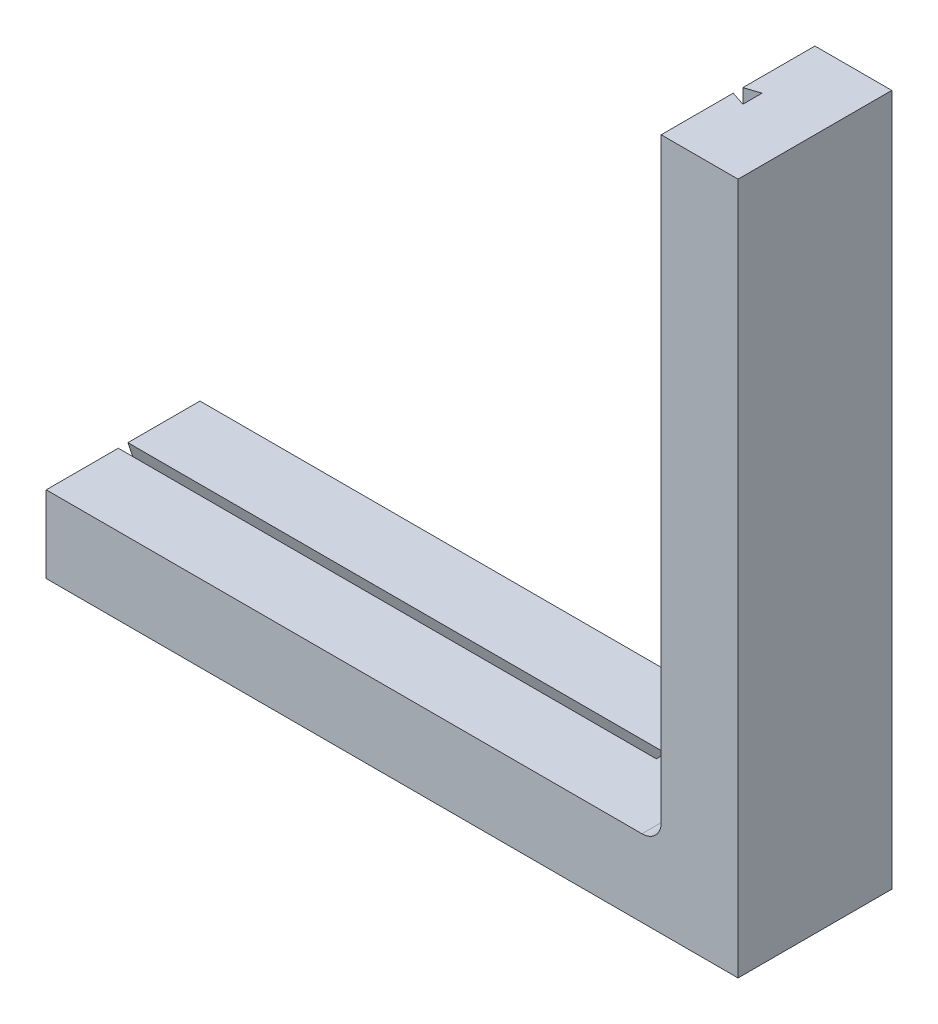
from build123d import *

# Parameters (mm, degrees)
SKETCH1_W               = 101.6
SKETCH1_H               = 914.4
EXTRUDE1_DEPTH          = 101.6
CUT_EXTRUDE1_DEPTH      = 711.2
CUT_EXTRUDE5_DEPTH      = 943.199639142
CUT_EXTRUDE5_DEPTH_BACK = 943.199639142
FILLET3_R               = 25.4


with BuildPart() as part:
    # Sketch1 → Extrude1 (new, symmetric)
    with BuildSketch(Plane.XY):
        with Locations((-50.8, 457.2)):
            Rectangle(SKETCH1_W, SKETCH1_H)
    extrude(amount=EXTRUDE1_DEPTH, both=True)

    # Sketch2 → Cut-Extrude1 (cut)
    with BuildSketch(Plane(origin=(0, 914.4, 0), x_dir=(1, 0, 0), z_dir=(0, 1, 0))):
        Polygon((-101.6, 6.35), (-82.55, 12.7), (-82.55, -12.7), (-101.6, -6.35), align=None)
    extrude(amount=-CUT_EXTRUDE1_DEPTH, mode=Mode.SUBTRACT)

    # Sketch10 → Cut-Extrude5 (cut, two sides: drawn at the far end of the back side and taken through both)
    with BuildSketch(Plane.XY.offset(101.6).offset(-CUT_EXTRUDE5_DEPTH_BACK)):
        Polygon((1308.185912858, -1308.185912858), (0, 0), (-101.6, 101.6), (-1409.785912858, 1409.785912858), (-4026.157738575, -1206.585912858), (-1308.185912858, -3924.557738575), align=None)
    extrude(amount=CUT_EXTRUDE5_DEPTH + CUT_EXTRUDE5_DEPTH_BACK, mode=Mode.SUBTRACT)

    # Mirror1: part across plane


with BuildPart() as part_1:
    add(part.part)
    add(part.part.mirror(Plane(origin=(0, 0, 1533.349548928), x_dir=(0, 0, 1), z_dir=(-0.7071067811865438, -0.7071067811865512, 0))))

    # Fillet3
    fillet3_edges = [part_1.edges().sort_by_distance(p)[0] for p in [
        (-101.6, 101.6, 0),
    ]]
    fillet(fillet3_edges, radius=FILLET3_R)


solid = part_1.part
